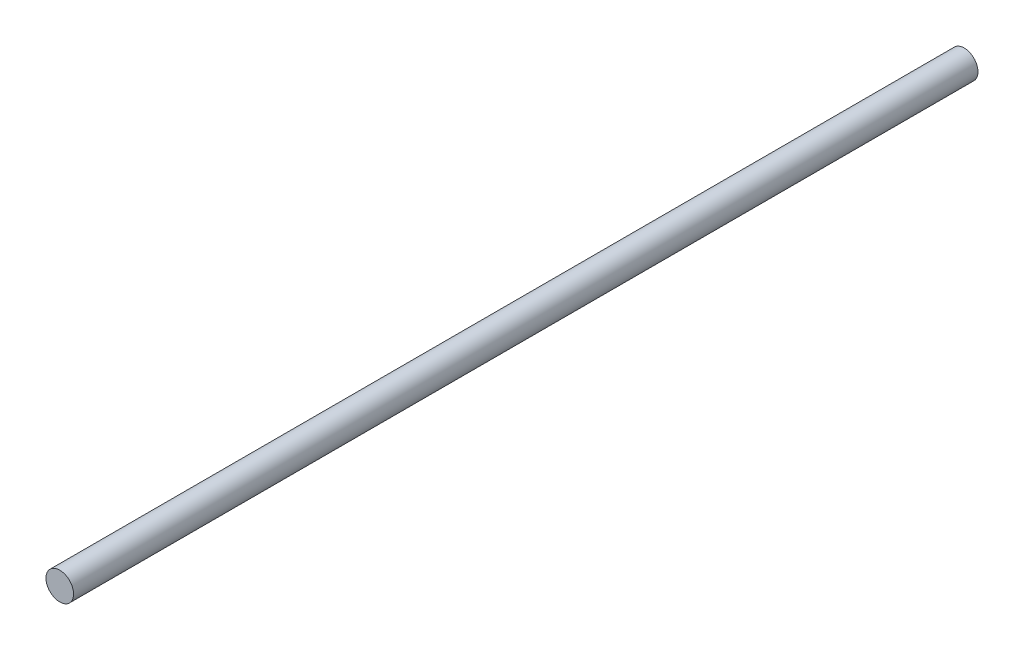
from build123d import *

# Parameters (mm, degrees)
ESQUISSE1_R          = 1.25
BASE_EXTRUSION_DEPTH = 82


with BuildPart() as part:
    # Esquisse1 → Base-Extrusion (new body)
    with BuildSketch(Plane.XY):
        with Locations((24, 27)):
            Circle(ESQUISSE1_R)
    extrude(amount=BASE_EXTRUSION_DEPTH)


solid = part.part
